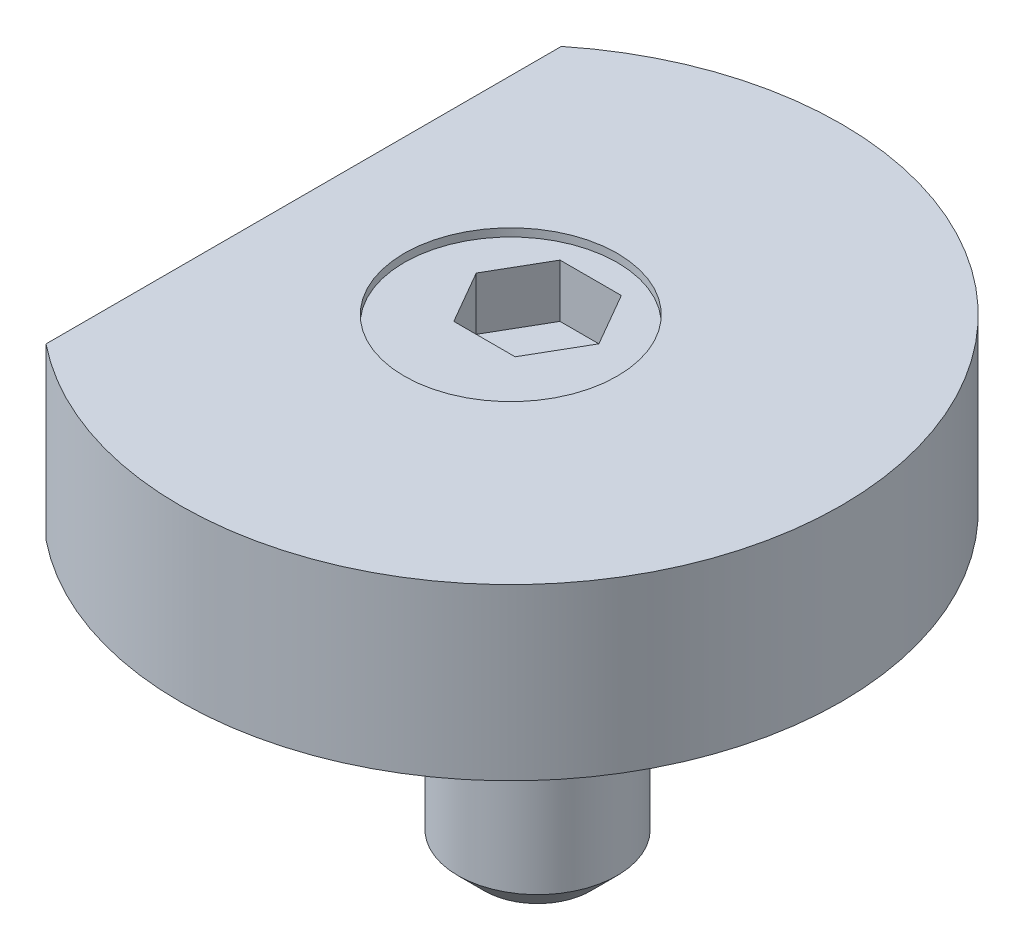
ISO-10303-21;
HEADER;
FILE_DESCRIPTION(('STEP AP214'),'2;1');
FILE_NAME('part.step','',(''),(''),'','','');
FILE_SCHEMA(('AUTOMOTIVE_DESIGN { 1 0 10303 214 1 1 1 1 }'));
ENDSEC;
DATA;
#1=APPLICATION_CONTEXT('core data for automotive mechanical design processes');
#2=APPLICATION_PROTOCOL_DEFINITION('international standard','automotive_design',2000,#1);
#3=PRODUCT_CONTEXT('',#1,'mechanical');
#4=PRODUCT('Part','Part','',(#3));
#5=PRODUCT_RELATED_PRODUCT_CATEGORY('part','',(#4));
#6=PRODUCT_DEFINITION_FORMATION('','',#4);
#7=PRODUCT_DEFINITION_CONTEXT('part definition',#1,'design');
#8=PRODUCT_DEFINITION('design','',#6,#7);
#9=PRODUCT_DEFINITION_SHAPE('','',#8);
#10=(LENGTH_UNIT() NAMED_UNIT(*) SI_UNIT(.MILLI.,.METRE.));
#11=(NAMED_UNIT(*) PLANE_ANGLE_UNIT() SI_UNIT($,.RADIAN.));
#12=(NAMED_UNIT(*) SI_UNIT($,.STERADIAN.) SOLID_ANGLE_UNIT());
#13=UNCERTAINTY_MEASURE_WITH_UNIT(LENGTH_MEASURE(1.E-05),#10,'distance_accuracy_value','');
#14=(GEOMETRIC_REPRESENTATION_CONTEXT(3) GLOBAL_UNCERTAINTY_ASSIGNED_CONTEXT((#13)) GLOBAL_UNIT_ASSIGNED_CONTEXT((#10,
#11,#12)) REPRESENTATION_CONTEXT('',''));
#15=CARTESIAN_POINT('',(0.,0.,0.));
#16=DIRECTION('',(0.,0.,1.));
#17=DIRECTION('',(1.,0.,0.));
#18=AXIS2_PLACEMENT_3D('',#15,#16,#17);
#19=CARTESIAN_POINT('',(0.,-11.9,-1.01));
#20=DIRECTION('',(0.,1.,0.));
#21=DIRECTION('',(0.,0.,1.));
#22=AXIS2_PLACEMENT_3D('',#19,#20,#21);
#23=CYLINDRICAL_SURFACE('',#22,3.);
#24=CARTESIAN_POINT('',(0.,-10.9,-1.01));
#25=DIRECTION('',(0.,1.,0.));
#26=DIRECTION('',(0.,0.,1.));
#27=AXIS2_PLACEMENT_3D('',#24,#25,#26);
#28=CIRCLE('',#27,3.);
#29=CARTESIAN_POINT('',(0.,-10.9,1.99));
#30=VERTEX_POINT('',#29);
#31=EDGE_CURVE('P0_E24',#30,#30,#28,.T.);
#32=ORIENTED_EDGE('',*,*,#31,.T.);
#33=EDGE_LOOP('',(#32));
#34=FACE_BOUND('',#33,.T.);
#35=CARTESIAN_POINT('',(0.,2.1,-1.01));
#36=DIRECTION('',(0.,1.,0.));
#37=DIRECTION('',(0.,0.,1.));
#38=AXIS2_PLACEMENT_3D('',#35,#36,#37);
#39=CIRCLE('',#38,3.);
#40=CARTESIAN_POINT('',(0.,2.1,-4.01));
#41=VERTEX_POINT('',#40);
#42=EDGE_CURVE('P0_E37',#41,#41,#39,.T.);
#43=ORIENTED_EDGE('',*,*,#42,.F.);
#44=EDGE_LOOP('',(#43));
#45=FACE_BOUND('',#44,.T.);
#46=ADVANCED_FACE('P0_F16',(#34,#45),#23,.T.);
#47=CARTESIAN_POINT('',(0.,-11.9,-1.01));
#48=DIRECTION('',(0.,1.,0.));
#49=DIRECTION('',(0.,0.,1.));
#50=AXIS2_PLACEMENT_3D('',#47,#48,#49);
#51=PLANE('',#50);
#52=CARTESIAN_POINT('',(0.,-11.9,-1.01));
#53=DIRECTION('',(0.,1.,0.));
#54=DIRECTION('',(0.,0.,1.));
#55=AXIS2_PLACEMENT_3D('',#52,#53,#54);
#56=CIRCLE('',#55,1.99999999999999);
#57=CARTESIAN_POINT('',(0.,-11.9,0.989999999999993));
#58=VERTEX_POINT('',#57);
#59=EDGE_CURVE('P0_E11',#58,#58,#56,.F.);
#60=ORIENTED_EDGE('',*,*,#59,.T.);
#61=EDGE_LOOP('',(#60));
#62=FACE_BOUND('',#61,.T.);
#63=ADVANCED_FACE('P0_F137',(#62),#51,.F.);
#64=CARTESIAN_POINT('',(0.,-10.9,-1.01));
#65=DIRECTION('',(0.,1.,0.));
#66=DIRECTION('',(0.,0.,1.));
#67=AXIS2_PLACEMENT_3D('',#64,#65,#66);
#68=CONICAL_SURFACE('',#67,3.,0.78539816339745);
#69=ORIENTED_EDGE('',*,*,#59,.F.);
#70=EDGE_LOOP('',(#69));
#71=FACE_BOUND('',#70,.T.);
#72=ORIENTED_EDGE('',*,*,#31,.F.);
#73=EDGE_LOOP('',(#72));
#74=FACE_BOUND('',#73,.T.);
#75=ADVANCED_FACE('P0_F18',(#71,#74),#68,.T.);
#76=CARTESIAN_POINT('',(0.,2.1,0.));
#77=DIRECTION('',(0.,1.,0.));
#78=DIRECTION('',(0.,0.,1.));
#79=AXIS2_PLACEMENT_3D('',#76,#77,#78);
#80=PLANE('',#79);
#81=CARTESIAN_POINT('',(0.,2.1,0.));
#82=DIRECTION('',(0.,1.,0.));
#83=DIRECTION('',(0.,0.,1.));
#84=AXIS2_PLACEMENT_3D('',#81,#82,#83);
#85=CIRCLE('',#84,4.01);
#86=EDGE_CURVE('P0_E118',#41,#41,#85,.T.);
#87=ORIENTED_EDGE('',*,*,#86,.F.);
#88=ORIENTED_EDGE('',*,*,#42,.T.);
#89=EDGE_LOOP('',(#87,#88));
#90=FACE_BOUND('',#89,.T.);
#91=ADVANCED_FACE('P0_F136',(#90),#80,.F.);
#92=CARTESIAN_POINT('',(0.,6.1,0.));
#93=DIRECTION('',(0.,-1.,0.));
#94=DIRECTION('',(0.,0.,-1.));
#95=AXIS2_PLACEMENT_3D('',#92,#93,#94);
#96=CYLINDRICAL_SURFACE('',#95,4.01);
#97=CARTESIAN_POINT('',(0.,6.1,0.));
#98=DIRECTION('',(0.,1.,0.));
#99=DIRECTION('',(0.,0.,1.));
#100=AXIS2_PLACEMENT_3D('',#97,#98,#99);
#101=CIRCLE('',#100,4.01);
#102=CARTESIAN_POINT('',(0.,6.1,4.01));
#103=VERTEX_POINT('',#102);
#104=EDGE_CURVE('P0_E126',#103,#103,#101,.T.);
#105=ORIENTED_EDGE('',*,*,#104,.F.);
#106=EDGE_LOOP('',(#105));
#107=FACE_BOUND('',#106,.T.);
#108=ORIENTED_EDGE('',*,*,#86,.T.);
#109=EDGE_LOOP('',(#108));
#110=FACE_BOUND('',#109,.T.);
#111=ADVANCED_FACE('P0_F144',(#107,#110),#96,.T.);
#112=CARTESIAN_POINT('',(0.,6.1,0.));
#113=DIRECTION('',(0.,1.,0.));
#114=DIRECTION('',(0.,0.,1.));
#115=AXIS2_PLACEMENT_3D('',#112,#113,#114);
#116=PLANE('',#115);
#117=DIRECTION('',(-0.5,0.,-0.866025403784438));
#118=VECTOR('',#117,1.);
#119=CARTESIAN_POINT('',(2.3094010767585,6.1,-1.01));
#120=LINE('',#119,#118);
#121=CARTESIAN_POINT('',(2.3094010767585,6.1,-1.01));
#122=VERTEX_POINT('',#121);
#123=CARTESIAN_POINT('',(1.15470053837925,6.1,-3.01));
#124=VERTEX_POINT('',#123);
#125=EDGE_CURVE('P0_E31',#122,#124,#120,.T.);
#126=ORIENTED_EDGE('',*,*,#125,.F.);
#127=DIRECTION('',(0.5,0.,-0.866025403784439));
#128=VECTOR('',#127,1.);
#129=CARTESIAN_POINT('',(1.15470053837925,6.1,0.99));
#130=LINE('',#129,#128);
#131=CARTESIAN_POINT('',(1.15470053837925,6.1,0.99));
#132=VERTEX_POINT('',#131);
#133=EDGE_CURVE('P0_E92',#132,#122,#130,.T.);
#134=ORIENTED_EDGE('',*,*,#133,.F.);
#135=DIRECTION('',(1.,0.,0.));
#136=VECTOR('',#135,1.);
#137=CARTESIAN_POINT('',(-1.15470053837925,6.1,0.99));
#138=LINE('',#137,#136);
#139=CARTESIAN_POINT('',(-1.15470053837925,6.1,0.99));
#140=VERTEX_POINT('',#139);
#141=EDGE_CURVE('P0_E95',#140,#132,#138,.T.);
#142=ORIENTED_EDGE('',*,*,#141,.F.);
#143=DIRECTION('',(0.5,0.,0.866025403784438));
#144=VECTOR('',#143,1.);
#145=CARTESIAN_POINT('',(-2.3094010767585,6.1,-1.01));
#146=LINE('',#145,#144);
#147=CARTESIAN_POINT('',(-2.3094010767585,6.1,-1.01));
#148=VERTEX_POINT('',#147);
#149=EDGE_CURVE('P0_E111',#148,#140,#146,.T.);
#150=ORIENTED_EDGE('',*,*,#149,.F.);
#151=DIRECTION('',(-0.5,0.,0.866025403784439));
#152=VECTOR('',#151,1.);
#153=CARTESIAN_POINT('',(-1.15470053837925,6.1,-3.01));
#154=LINE('',#153,#152);
#155=CARTESIAN_POINT('',(-1.15470053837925,6.1,-3.01));
#156=VERTEX_POINT('',#155);
#157=EDGE_CURVE('P0_E108',#156,#148,#154,.T.);
#158=ORIENTED_EDGE('',*,*,#157,.F.);
#159=DIRECTION('',(-1.,0.,0.));
#160=VECTOR('',#159,1.);
#161=CARTESIAN_POINT('',(1.15470053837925,6.1,-3.01));
#162=LINE('',#161,#160);
#163=EDGE_CURVE('P0_E106',#124,#156,#162,.T.);
#164=ORIENTED_EDGE('',*,*,#163,.F.);
#165=EDGE_LOOP('',(#126,#134,#142,#150,#158,#164));
#166=FACE_BOUND('',#165,.T.);
#167=ORIENTED_EDGE('',*,*,#104,.T.);
#168=EDGE_LOOP('',(#167));
#169=FACE_BOUND('',#168,.T.);
#170=ADVANCED_FACE('P0_F155',(#166,#169),#116,.T.);
#171=CARTESIAN_POINT('',(2.3094010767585,4.1,-1.01));
#172=DIRECTION('',(0.866025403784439,0.,-0.5));
#173=DIRECTION('',(-0.5,0.,-0.866025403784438));
#174=AXIS2_PLACEMENT_3D('',#171,#172,#173);
#175=PLANE('',#174);
#176=ORIENTED_EDGE('',*,*,#125,.T.);
#177=DIRECTION('',(0.,1.,0.));
#178=VECTOR('',#177,1.);
#179=CARTESIAN_POINT('',(1.15470053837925,4.1,-3.01));
#180=LINE('',#179,#178);
#181=CARTESIAN_POINT('',(1.15470053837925,4.1,-3.01));
#182=VERTEX_POINT('',#181);
#183=EDGE_CURVE('P0_E69',#182,#124,#180,.T.);
#184=ORIENTED_EDGE('',*,*,#183,.F.);
#185=DIRECTION('',(-0.5,0.,-0.866025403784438));
#186=VECTOR('',#185,1.);
#187=CARTESIAN_POINT('',(2.3094010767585,4.1,-1.01));
#188=LINE('',#187,#186);
#189=CARTESIAN_POINT('',(2.3094010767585,4.1,-1.01));
#190=VERTEX_POINT('',#189);
#191=EDGE_CURVE('P0_E73',#190,#182,#188,.T.);
#192=ORIENTED_EDGE('',*,*,#191,.F.);
#193=DIRECTION('',(0.,1.,0.));
#194=VECTOR('',#193,1.);
#195=CARTESIAN_POINT('',(2.3094010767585,4.1,-1.01));
#196=LINE('',#195,#194);
#197=EDGE_CURVE('P0_E116',#190,#122,#196,.T.);
#198=ORIENTED_EDGE('',*,*,#197,.T.);
#199=EDGE_LOOP('',(#176,#184,#192,#198));
#200=FACE_BOUND('',#199,.T.);
#201=ADVANCED_FACE('P0_F71',(#200),#175,.F.);
#202=CARTESIAN_POINT('',(1.15470053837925,4.1,0.99));
#203=DIRECTION('',(0.866025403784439,0.,0.5));
#204=DIRECTION('',(0.5,0.,-0.866025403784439));
#205=AXIS2_PLACEMENT_3D('',#202,#203,#204);
#206=PLANE('',#205);
#207=ORIENTED_EDGE('',*,*,#133,.T.);
#208=ORIENTED_EDGE('',*,*,#197,.F.);
#209=DIRECTION('',(0.5,0.,-0.866025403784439));
#210=VECTOR('',#209,1.);
#211=CARTESIAN_POINT('',(1.15470053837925,4.1,0.99));
#212=LINE('',#211,#210);
#213=CARTESIAN_POINT('',(1.15470053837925,4.1,0.99));
#214=VERTEX_POINT('',#213);
#215=EDGE_CURVE('P0_E79',#214,#190,#212,.T.);
#216=ORIENTED_EDGE('',*,*,#215,.F.);
#217=DIRECTION('',(0.,1.,0.));
#218=VECTOR('',#217,1.);
#219=CARTESIAN_POINT('',(1.15470053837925,4.1,0.99));
#220=LINE('',#219,#218);
#221=EDGE_CURVE('P0_E119',#214,#132,#220,.T.);
#222=ORIENTED_EDGE('',*,*,#221,.T.);
#223=EDGE_LOOP('',(#207,#208,#216,#222));
#224=FACE_BOUND('',#223,.T.);
#225=ADVANCED_FACE('P0_F163',(#224),#206,.F.);
#226=CARTESIAN_POINT('',(-1.15470053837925,4.1,0.99));
#227=DIRECTION('',(0.,0.,1.));
#228=DIRECTION('',(1.,0.,0.));
#229=AXIS2_PLACEMENT_3D('',#226,#227,#228);
#230=PLANE('',#229);
#231=ORIENTED_EDGE('',*,*,#141,.T.);
#232=ORIENTED_EDGE('',*,*,#221,.F.);
#233=DIRECTION('',(1.,0.,0.));
#234=VECTOR('',#233,1.);
#235=CARTESIAN_POINT('',(-1.15470053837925,4.1,0.99));
#236=LINE('',#235,#234);
#237=CARTESIAN_POINT('',(-1.15470053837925,4.1,0.99));
#238=VERTEX_POINT('',#237);
#239=EDGE_CURVE('P0_E102',#238,#214,#236,.T.);
#240=ORIENTED_EDGE('',*,*,#239,.F.);
#241=DIRECTION('',(0.,1.,0.));
#242=VECTOR('',#241,1.);
#243=CARTESIAN_POINT('',(-1.15470053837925,4.1,0.99));
#244=LINE('',#243,#242);
#245=EDGE_CURVE('P0_E121',#238,#140,#244,.T.);
#246=ORIENTED_EDGE('',*,*,#245,.T.);
#247=EDGE_LOOP('',(#231,#232,#240,#246));
#248=FACE_BOUND('',#247,.T.);
#249=ADVANCED_FACE('P0_F173',(#248),#230,.F.);
#250=CARTESIAN_POINT('',(-2.3094010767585,4.1,-1.01));
#251=DIRECTION('',(-0.866025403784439,0.,0.5));
#252=DIRECTION('',(0.5,0.,0.866025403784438));
#253=AXIS2_PLACEMENT_3D('',#250,#251,#252);
#254=PLANE('',#253);
#255=ORIENTED_EDGE('',*,*,#149,.T.);
#256=ORIENTED_EDGE('',*,*,#245,.F.);
#257=DIRECTION('',(0.5,0.,0.866025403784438));
#258=VECTOR('',#257,1.);
#259=CARTESIAN_POINT('',(-2.3094010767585,4.1,-1.01));
#260=LINE('',#259,#258);
#261=CARTESIAN_POINT('',(-2.3094010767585,4.1,-1.01));
#262=VERTEX_POINT('',#261);
#263=EDGE_CURVE('P0_E99',#262,#238,#260,.T.);
#264=ORIENTED_EDGE('',*,*,#263,.F.);
#265=DIRECTION('',(0.,1.,0.));
#266=VECTOR('',#265,1.);
#267=CARTESIAN_POINT('',(-2.3094010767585,4.1,-1.01));
#268=LINE('',#267,#266);
#269=EDGE_CURVE('P0_E123',#262,#148,#268,.T.);
#270=ORIENTED_EDGE('',*,*,#269,.T.);
#271=EDGE_LOOP('',(#255,#256,#264,#270));
#272=FACE_BOUND('',#271,.T.);
#273=ADVANCED_FACE('P0_F169',(#272),#254,.F.);
#274=CARTESIAN_POINT('',(-1.15470053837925,4.1,-3.01));
#275=DIRECTION('',(-0.866025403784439,0.,-0.5));
#276=DIRECTION('',(-0.5,0.,0.866025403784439));
#277=AXIS2_PLACEMENT_3D('',#274,#275,#276);
#278=PLANE('',#277);
#279=ORIENTED_EDGE('',*,*,#157,.T.);
#280=ORIENTED_EDGE('',*,*,#269,.F.);
#281=DIRECTION('',(-0.5,0.,0.866025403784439));
#282=VECTOR('',#281,1.);
#283=CARTESIAN_POINT('',(-1.15470053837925,4.1,-3.01));
#284=LINE('',#283,#282);
#285=CARTESIAN_POINT('',(-1.15470053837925,4.1,-3.01));
#286=VERTEX_POINT('',#285);
#287=EDGE_CURVE('P0_E87',#286,#262,#284,.T.);
#288=ORIENTED_EDGE('',*,*,#287,.F.);
#289=DIRECTION('',(0.,1.,0.));
#290=VECTOR('',#289,1.);
#291=CARTESIAN_POINT('',(-1.15470053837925,4.1,-3.01));
#292=LINE('',#291,#290);
#293=EDGE_CURVE('P0_E78',#286,#156,#292,.T.);
#294=ORIENTED_EDGE('',*,*,#293,.T.);
#295=EDGE_LOOP('',(#279,#280,#288,#294));
#296=FACE_BOUND('',#295,.T.);
#297=ADVANCED_FACE('P0_F166',(#296),#278,.F.);
#298=CARTESIAN_POINT('',(1.15470053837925,4.1,-3.01));
#299=DIRECTION('',(0.,0.,-1.));
#300=DIRECTION('',(-1.,0.,0.));
#301=AXIS2_PLACEMENT_3D('',#298,#299,#300);
#302=PLANE('',#301);
#303=ORIENTED_EDGE('',*,*,#163,.T.);
#304=ORIENTED_EDGE('',*,*,#293,.F.);
#305=DIRECTION('',(-1.,0.,0.));
#306=VECTOR('',#305,1.);
#307=CARTESIAN_POINT('',(1.15470053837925,4.1,-3.01));
#308=LINE('',#307,#306);
#309=EDGE_CURVE('P0_E82',#182,#286,#308,.T.);
#310=ORIENTED_EDGE('',*,*,#309,.F.);
#311=ORIENTED_EDGE('',*,*,#183,.T.);
#312=EDGE_LOOP('',(#303,#304,#310,#311));
#313=FACE_BOUND('',#312,.T.);
#314=ADVANCED_FACE('P0_F83',(#313),#302,.F.);
#315=CARTESIAN_POINT('',(1.15470053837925,4.1,-3.01));
#316=DIRECTION('',(0.,1.,0.));
#317=DIRECTION('',(0.,0.,1.));
#318=AXIS2_PLACEMENT_3D('',#315,#316,#317);
#319=PLANE('',#318);
#320=ORIENTED_EDGE('',*,*,#191,.T.);
#321=ORIENTED_EDGE('',*,*,#309,.T.);
#322=ORIENTED_EDGE('',*,*,#287,.T.);
#323=ORIENTED_EDGE('',*,*,#263,.T.);
#324=ORIENTED_EDGE('',*,*,#239,.T.);
#325=ORIENTED_EDGE('',*,*,#215,.T.);
#326=EDGE_LOOP('',(#320,#321,#322,#323,#324,#325));
#327=FACE_BOUND('',#326,.T.);
#328=ADVANCED_FACE('P0_F89',(#327),#319,.T.);
#329=CLOSED_SHELL('',(#46,#63,#75,#91,#111,#170,#201,#225,#249,#273,#297,#314,#328));
#330=MANIFOLD_SOLID_BREP('P0_B1',#329);
#331=CARTESIAN_POINT('',(0.,6.4,-1.01));
#332=DIRECTION('',(0.,-1.,0.));
#333=DIRECTION('',(0.,0.,-1.));
#334=AXIS2_PLACEMENT_3D('',#331,#332,#333);
#335=CYLINDRICAL_SURFACE('',#334,3.);
#336=CARTESIAN_POINT('',(0.,0.,-1.01));
#337=DIRECTION('',(0.,1.,0.));
#338=DIRECTION('',(0.,0.,1.));
#339=AXIS2_PLACEMENT_3D('',#336,#337,#338);
#340=CIRCLE('',#339,3.);
#341=CARTESIAN_POINT('',(0.,0.,1.99));
#342=VERTEX_POINT('',#341);
#343=EDGE_CURVE('P1_E61',#342,#342,#340,.T.);
#344=ORIENTED_EDGE('',*,*,#343,.F.);
#345=EDGE_LOOP('',(#344));
#346=FACE_BOUND('',#345,.T.);
#347=CARTESIAN_POINT('',(0.,2.1,-1.01));
#348=DIRECTION('',(0.,1.,0.));
#349=DIRECTION('',(0.,0.,1.));
#350=AXIS2_PLACEMENT_3D('',#347,#348,#349);
#351=CIRCLE('',#350,3.);
#352=CARTESIAN_POINT('',(0.,2.1,-4.01));
#353=VERTEX_POINT('',#352);
#354=EDGE_CURVE('P1_E10',#353,#353,#351,.T.);
#355=ORIENTED_EDGE('',*,*,#354,.T.);
#356=EDGE_LOOP('',(#355));
#357=FACE_BOUND('',#356,.T.);
#358=ADVANCED_FACE('P1_F15',(#346,#357),#335,.F.);
#359=CARTESIAN_POINT('',(0.,6.4,0.));
#360=DIRECTION('',(0.,1.,0.));
#361=DIRECTION('',(0.,0.,1.));
#362=AXIS2_PLACEMENT_3D('',#359,#360,#361);
#363=PLANE('',#362);
#364=CARTESIAN_POINT('',(0.,6.4,0.));
#365=DIRECTION('',(0.,1.,0.));
#366=DIRECTION('',(0.,0.,1.));
#367=AXIS2_PLACEMENT_3D('',#364,#365,#366);
#368=CIRCLE('',#367,4.01);
#369=CARTESIAN_POINT('',(0.,6.4,4.01));
#370=VERTEX_POINT('',#369);
#371=EDGE_CURVE('P1_E68',#370,#370,#368,.T.);
#372=ORIENTED_EDGE('',*,*,#371,.F.);
#373=EDGE_LOOP('',(#372));
#374=FACE_BOUND('',#373,.T.);
#375=CARTESIAN_POINT('',(0.,6.4,0.));
#376=DIRECTION('',(0.,1.,0.));
#377=DIRECTION('',(0.,0.,1.));
#378=AXIS2_PLACEMENT_3D('',#375,#376,#377);
#379=CIRCLE('',#378,12.45);
#380=CARTESIAN_POINT('',(-7.8,6.4,9.70373639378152));
#381=VERTEX_POINT('',#380);
#382=CARTESIAN_POINT('',(-7.8,6.4,-9.70373639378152));
#383=VERTEX_POINT('',#382);
#384=EDGE_CURVE('P1_E54',#381,#383,#379,.T.);
#385=ORIENTED_EDGE('',*,*,#384,.T.);
#386=DIRECTION('',(0.,0.,1.));
#387=VECTOR('',#386,1.);
#388=CARTESIAN_POINT('',(-7.8,6.4,-9.70373639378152));
#389=LINE('',#388,#387);
#390=EDGE_CURVE('P1_E35',#383,#381,#389,.T.);
#391=ORIENTED_EDGE('',*,*,#390,.T.);
#392=EDGE_LOOP('',(#385,#391));
#393=FACE_BOUND('',#392,.T.);
#394=ADVANCED_FACE('P1_F76',(#374,#393),#363,.T.);
#395=CARTESIAN_POINT('',(0.,0.,0.));
#396=DIRECTION('',(0.,1.,0.));
#397=DIRECTION('',(0.,0.,1.));
#398=AXIS2_PLACEMENT_3D('',#395,#396,#397);
#399=PLANE('',#398);
#400=CARTESIAN_POINT('',(0.,0.,0.));
#401=DIRECTION('',(0.,1.,0.));
#402=DIRECTION('',(0.,0.,1.));
#403=AXIS2_PLACEMENT_3D('',#400,#401,#402);
#404=CIRCLE('',#403,12.45);
#405=CARTESIAN_POINT('',(-7.8,0.,9.70373639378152));
#406=VERTEX_POINT('',#405);
#407=CARTESIAN_POINT('',(-7.8,0.,-9.70373639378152));
#408=VERTEX_POINT('',#407);
#409=EDGE_CURVE('P1_E55',#406,#408,#404,.T.);
#410=ORIENTED_EDGE('',*,*,#409,.F.);
#411=DIRECTION('',(0.,0.,1.));
#412=VECTOR('',#411,1.);
#413=CARTESIAN_POINT('',(-7.8,0.,-9.70373639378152));
#414=LINE('',#413,#412);
#415=EDGE_CURVE('P1_E45',#408,#406,#414,.T.);
#416=ORIENTED_EDGE('',*,*,#415,.F.);
#417=EDGE_LOOP('',(#410,#416));
#418=FACE_BOUND('',#417,.T.);
#419=ORIENTED_EDGE('',*,*,#343,.T.);
#420=EDGE_LOOP('',(#419));
#421=FACE_BOUND('',#420,.T.);
#422=ADVANCED_FACE('P1_F59',(#418,#421),#399,.F.);
#423=CARTESIAN_POINT('',(0.,6.4,0.));
#424=DIRECTION('',(0.,-1.,0.));
#425=DIRECTION('',(0.,0.,-1.));
#426=AXIS2_PLACEMENT_3D('',#423,#424,#425);
#427=CYLINDRICAL_SURFACE('',#426,12.45);
#428=ORIENTED_EDGE('',*,*,#409,.T.);
#429=DIRECTION('',(0.,-1.,0.));
#430=VECTOR('',#429,1.);
#431=CARTESIAN_POINT('',(-7.8,6.4,-9.70373639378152));
#432=LINE('',#431,#430);
#433=EDGE_CURVE('P1_E23',#383,#408,#432,.T.);
#434=ORIENTED_EDGE('',*,*,#433,.F.);
#435=ORIENTED_EDGE('',*,*,#384,.F.);
#436=DIRECTION('',(0.,-1.,0.));
#437=VECTOR('',#436,1.);
#438=CARTESIAN_POINT('',(-7.8,6.4,9.70373639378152));
#439=LINE('',#438,#437);
#440=EDGE_CURVE('P1_E48',#381,#406,#439,.T.);
#441=ORIENTED_EDGE('',*,*,#440,.T.);
#442=EDGE_LOOP('',(#428,#434,#435,#441));
#443=FACE_BOUND('',#442,.T.);
#444=ADVANCED_FACE('P1_F17',(#443),#427,.T.);
#445=CARTESIAN_POINT('',(-7.8,6.4,-9.70373639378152));
#446=DIRECTION('',(1.,0.,0.));
#447=DIRECTION('',(0.,0.,-1.));
#448=AXIS2_PLACEMENT_3D('',#445,#446,#447);
#449=PLANE('',#448);
#450=ORIENTED_EDGE('',*,*,#415,.T.);
#451=ORIENTED_EDGE('',*,*,#440,.F.);
#452=ORIENTED_EDGE('',*,*,#390,.F.);
#453=ORIENTED_EDGE('',*,*,#433,.T.);
#454=EDGE_LOOP('',(#450,#451,#452,#453));
#455=FACE_BOUND('',#454,.T.);
#456=ADVANCED_FACE('P1_F47',(#455),#449,.F.);
#457=CARTESIAN_POINT('',(0.,2.1,0.));
#458=DIRECTION('',(0.,1.,0.));
#459=DIRECTION('',(0.,0.,1.));
#460=AXIS2_PLACEMENT_3D('',#457,#458,#459);
#461=CYLINDRICAL_SURFACE('',#460,4.01);
#462=ORIENTED_EDGE('',*,*,#371,.T.);
#463=EDGE_LOOP('',(#462));
#464=FACE_BOUND('',#463,.T.);
#465=CARTESIAN_POINT('',(0.,2.1,0.));
#466=DIRECTION('',(0.,1.,0.));
#467=DIRECTION('',(0.,0.,1.));
#468=AXIS2_PLACEMENT_3D('',#465,#466,#467);
#469=CIRCLE('',#468,4.01);
#470=EDGE_CURVE('P1_E28',#353,#353,#469,.T.);
#471=ORIENTED_EDGE('',*,*,#470,.F.);
#472=EDGE_LOOP('',(#471));
#473=FACE_BOUND('',#472,.T.);
#474=ADVANCED_FACE('P1_F87',(#464,#473),#461,.F.);
#475=CARTESIAN_POINT('',(0.,2.1,0.));
#476=DIRECTION('',(0.,1.,0.));
#477=DIRECTION('',(0.,0.,1.));
#478=AXIS2_PLACEMENT_3D('',#475,#476,#477);
#479=PLANE('',#478);
#480=ORIENTED_EDGE('',*,*,#470,.T.);
#481=ORIENTED_EDGE('',*,*,#354,.F.);
#482=EDGE_LOOP('',(#480,#481));
#483=FACE_BOUND('',#482,.T.);
#484=ADVANCED_FACE('P1_F73',(#483),#479,.T.);
#485=CLOSED_SHELL('',(#358,#394,#422,#444,#456,#474,#484));
#486=MANIFOLD_SOLID_BREP('P1_B1',#485);
#487=ADVANCED_BREP_SHAPE_REPRESENTATION('',(#18,#330,#486),#14);
#488=SHAPE_DEFINITION_REPRESENTATION(#9,#487);
ENDSEC;
END-ISO-10303-21;
